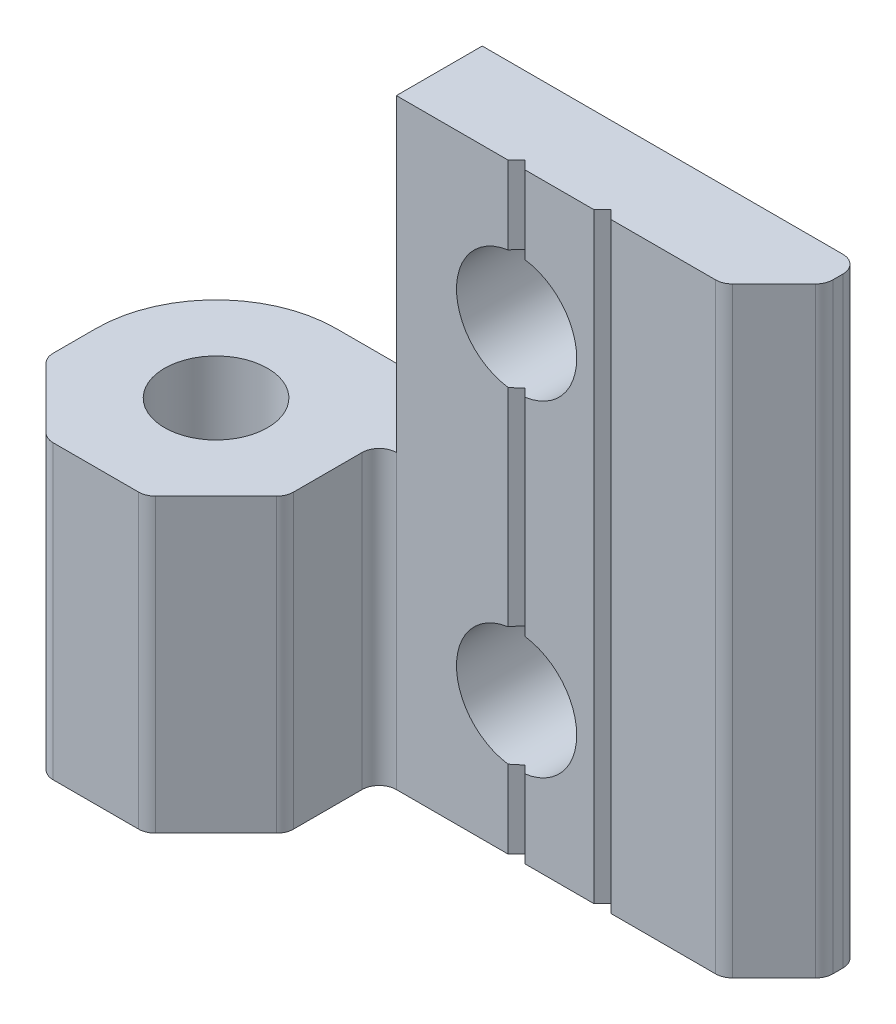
ISO-10303-21;
HEADER;
FILE_DESCRIPTION(('STEP AP214'),'2;1');
FILE_NAME('part.step','',(''),(''),'','','');
FILE_SCHEMA(('AUTOMOTIVE_DESIGN { 1 0 10303 214 1 1 1 1 }'));
ENDSEC;
DATA;
#1=APPLICATION_CONTEXT('core data for automotive mechanical design processes');
#2=APPLICATION_PROTOCOL_DEFINITION('international standard','automotive_design',2000,#1);
#3=PRODUCT_CONTEXT('',#1,'mechanical');
#4=PRODUCT('Part','Part','',(#3));
#5=PRODUCT_RELATED_PRODUCT_CATEGORY('part','',(#4));
#6=PRODUCT_DEFINITION_FORMATION('','',#4);
#7=PRODUCT_DEFINITION_CONTEXT('part definition',#1,'design');
#8=PRODUCT_DEFINITION('design','',#6,#7);
#9=PRODUCT_DEFINITION_SHAPE('','',#8);
#10=(LENGTH_UNIT() NAMED_UNIT(*) SI_UNIT(.MILLI.,.METRE.));
#11=(NAMED_UNIT(*) PLANE_ANGLE_UNIT() SI_UNIT($,.RADIAN.));
#12=(NAMED_UNIT(*) SI_UNIT($,.STERADIAN.) SOLID_ANGLE_UNIT());
#13=UNCERTAINTY_MEASURE_WITH_UNIT(LENGTH_MEASURE(1.E-05),#10,'distance_accuracy_value','');
#14=(GEOMETRIC_REPRESENTATION_CONTEXT(3) GLOBAL_UNCERTAINTY_ASSIGNED_CONTEXT((#13)) GLOBAL_UNIT_ASSIGNED_CONTEXT((#10,
#11,#12)) REPRESENTATION_CONTEXT('',''));
#15=CARTESIAN_POINT('',(0.,0.,0.));
#16=DIRECTION('',(0.,0.,1.));
#17=DIRECTION('',(1.,0.,0.));
#18=AXIS2_PLACEMENT_3D('',#15,#16,#17);
#19=CARTESIAN_POINT('',(15.,35.,-2.99999999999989));
#20=DIRECTION('',(-0.707106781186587,0.,-0.707106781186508));
#21=DIRECTION('',(-0.707106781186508,0.,0.707106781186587));
#22=AXIS2_PLACEMENT_3D('',#19,#20,#21);
#23=PLANE('',#22);
#24=DIRECTION('',(0.,-1.,0.));
#25=VECTOR('',#24,1.);
#26=CARTESIAN_POINT('',(14.5,35.,-2.49999999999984));
#27=LINE('',#26,#25);
#28=CARTESIAN_POINT('',(14.5,35.,-2.49999999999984));
#29=VERTEX_POINT('',#28);
#30=CARTESIAN_POINT('',(14.5,30.4641016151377,-2.49999999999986));
#31=VERTEX_POINT('',#30);
#32=EDGE_CURVE('E274',#29,#31,#27,.T.);
#33=ORIENTED_EDGE('',*,*,#32,.T.);
#34=CARTESIAN_POINT('',(15.,27.,-2.99999999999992));
#35=DIRECTION('',(-0.707106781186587,0.,-0.707106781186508));
#36=DIRECTION('',(-0.707106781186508,0.,0.707106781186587));
#37=AXIS2_PLACEMENT_3D('',#34,#35,#36);
#38=ELLIPSE('',#37,4.9497474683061,3.49999999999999);
#39=CARTESIAN_POINT('',(15.,30.5,-2.99999999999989));
#40=VERTEX_POINT('',#39);
#41=EDGE_CURVE('E257',#31,#40,#38,.T.);
#42=ORIENTED_EDGE('',*,*,#41,.T.);
#43=DIRECTION('',(0.,-1.,0.));
#44=VECTOR('',#43,1.);
#45=CARTESIAN_POINT('',(15.,35.,-2.99999999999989));
#46=LINE('',#45,#44);
#47=CARTESIAN_POINT('',(15.,35.,-2.99999999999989));
#48=VERTEX_POINT('',#47);
#49=EDGE_CURVE('E286',#48,#40,#46,.T.);
#50=ORIENTED_EDGE('',*,*,#49,.F.);
#51=DIRECTION('',(0.707106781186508,0.,-0.707106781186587));
#52=VECTOR('',#51,1.);
#53=CARTESIAN_POINT('',(15.,35.,-2.99999999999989));
#54=LINE('',#53,#52);
#55=EDGE_CURVE('E279',#29,#48,#54,.T.);
#56=ORIENTED_EDGE('',*,*,#55,.F.);
#57=EDGE_LOOP('',(#33,#42,#50,#56));
#58=FACE_BOUND('',#57,.T.);
#59=ADVANCED_FACE('F34',(#58),#23,.F.);
#60=CARTESIAN_POINT('',(15.,35.,-2.99999999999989));
#61=DIRECTION('',(0.707106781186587,0.,-0.707106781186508));
#62=DIRECTION('',(-0.707106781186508,0.,-0.707106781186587));
#63=AXIS2_PLACEMENT_3D('',#60,#61,#62);
#64=PLANE('',#63);
#65=DIRECTION('',(0.,-1.,0.));
#66=VECTOR('',#65,1.);
#67=CARTESIAN_POINT('',(15.5,35.,-2.49999999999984));
#68=LINE('',#67,#66);
#69=CARTESIAN_POINT('',(15.5,23.5358983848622,-2.49999999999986));
#70=VERTEX_POINT('',#69);
#71=CARTESIAN_POINT('',(15.5,11.4641016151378,-2.49999999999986));
#72=VERTEX_POINT('',#71);
#73=EDGE_CURVE('E302',#70,#72,#68,.T.);
#74=ORIENTED_EDGE('',*,*,#73,.F.);
#75=CARTESIAN_POINT('',(15.,27.,-2.99999999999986));
#76=DIRECTION('',(0.707106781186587,0.,-0.707106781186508));
#77=DIRECTION('',(0.707106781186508,0.,0.707106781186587));
#78=AXIS2_PLACEMENT_3D('',#75,#76,#77);
#79=ELLIPSE('',#78,4.9497474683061,3.49999999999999);
#80=CARTESIAN_POINT('',(15.,23.5,-2.99999999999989));
#81=VERTEX_POINT('',#80);
#82=EDGE_CURVE('E11',#70,#81,#79,.T.);
#83=ORIENTED_EDGE('',*,*,#82,.T.);
#84=CARTESIAN_POINT('',(15.,11.5,-2.99999999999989));
#85=VERTEX_POINT('',#84);
#86=EDGE_CURVE('E292',#81,#85,#46,.T.);
#87=ORIENTED_EDGE('',*,*,#86,.T.);
#88=CARTESIAN_POINT('',(15.,8.,-2.99999999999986));
#89=DIRECTION('',(0.707106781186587,0.,-0.707106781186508));
#90=DIRECTION('',(0.707106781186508,0.,0.707106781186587));
#91=AXIS2_PLACEMENT_3D('',#88,#89,#90);
#92=ELLIPSE('',#91,4.9497474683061,3.49999999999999);
#93=EDGE_CURVE('E490',#85,#72,#92,.T.);
#94=ORIENTED_EDGE('',*,*,#93,.T.);
#95=EDGE_LOOP('',(#74,#83,#87,#94));
#96=FACE_BOUND('',#95,.T.);
#97=ADVANCED_FACE('F506',(#96),#64,.F.);
#98=ORIENTED_EDGE('',*,*,#86,.F.);
#99=CARTESIAN_POINT('',(14.5,23.5358983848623,-2.49999999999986));
#100=VERTEX_POINT('',#99);
#101=EDGE_CURVE('E267',#81,#100,#38,.T.);
#102=ORIENTED_EDGE('',*,*,#101,.T.);
#103=CARTESIAN_POINT('',(14.5,11.4641016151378,-2.49999999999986));
#104=VERTEX_POINT('',#103);
#105=EDGE_CURVE('E277',#100,#104,#27,.T.);
#106=ORIENTED_EDGE('',*,*,#105,.T.);
#107=CARTESIAN_POINT('',(15.,8.,-2.99999999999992));
#108=DIRECTION('',(-0.707106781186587,0.,-0.707106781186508));
#109=DIRECTION('',(-0.707106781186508,0.,0.707106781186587));
#110=AXIS2_PLACEMENT_3D('',#107,#108,#109);
#111=ELLIPSE('',#110,4.9497474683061,3.49999999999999);
#112=EDGE_CURVE('E487',#104,#85,#111,.T.);
#113=ORIENTED_EDGE('',*,*,#112,.T.);
#114=EDGE_LOOP('',(#98,#102,#106,#113));
#115=FACE_BOUND('',#114,.T.);
#116=ADVANCED_FACE('F502',(#115),#23,.F.);
#117=CARTESIAN_POINT('',(15.5,4.53589838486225,-2.49999999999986));
#118=VERTEX_POINT('',#117);
#119=CARTESIAN_POINT('',(15.5,0.,-2.49999999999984));
#120=VERTEX_POINT('',#119);
#121=EDGE_CURVE('E303',#118,#120,#68,.T.);
#122=ORIENTED_EDGE('',*,*,#121,.F.);
#123=CARTESIAN_POINT('',(15.,4.50000000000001,-2.99999999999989));
#124=VERTEX_POINT('',#123);
#125=EDGE_CURVE('E57',#118,#124,#92,.T.);
#126=ORIENTED_EDGE('',*,*,#125,.T.);
#127=CARTESIAN_POINT('',(15.,0.,-2.99999999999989));
#128=VERTEX_POINT('',#127);
#129=EDGE_CURVE('E293',#124,#128,#46,.T.);
#130=ORIENTED_EDGE('',*,*,#129,.T.);
#131=DIRECTION('',(0.707106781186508,0.,0.707106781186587));
#132=VECTOR('',#131,1.);
#133=CARTESIAN_POINT('',(15.,0.,-2.99999999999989));
#134=LINE('',#133,#132);
#135=EDGE_CURVE('E345',#128,#120,#134,.T.);
#136=ORIENTED_EDGE('',*,*,#135,.T.);
#137=EDGE_LOOP('',(#122,#126,#130,#136));
#138=FACE_BOUND('',#137,.T.);
#139=ADVANCED_FACE('F556',(#138),#64,.F.);
#140=CARTESIAN_POINT('',(19.5,35.,-2.49999999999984));
#141=DIRECTION('',(0.,0.,-1.));
#142=DIRECTION('',(-1.,0.,0.));
#143=AXIS2_PLACEMENT_3D('',#140,#141,#142);
#144=PLANE('',#143);
#145=CARTESIAN_POINT('',(15.5,35.,-2.49999999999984));
#146=VERTEX_POINT('',#145);
#147=CARTESIAN_POINT('',(15.5,30.4641016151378,-2.49999999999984));
#148=VERTEX_POINT('',#147);
#149=EDGE_CURVE('E297',#146,#148,#68,.T.);
#150=ORIENTED_EDGE('',*,*,#149,.T.);
#151=CARTESIAN_POINT('',(15.,27.,-2.49999999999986));
#152=DIRECTION('',(0.,0.,1.));
#153=DIRECTION('',(1.,0.,0.));
#154=AXIS2_PLACEMENT_3D('',#151,#152,#153);
#155=CIRCLE('',#154,3.5);
#156=EDGE_CURVE('E49',#70,#148,#155,.T.);
#157=ORIENTED_EDGE('',*,*,#156,.F.);
#158=ORIENTED_EDGE('',*,*,#73,.T.);
#159=CARTESIAN_POINT('',(15.,8.,-2.49999999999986));
#160=DIRECTION('',(0.,0.,1.));
#161=DIRECTION('',(1.,0.,0.));
#162=AXIS2_PLACEMENT_3D('',#159,#160,#161);
#163=CIRCLE('',#162,3.5);
#164=EDGE_CURVE('E496',#118,#72,#163,.T.);
#165=ORIENTED_EDGE('',*,*,#164,.F.);
#166=ORIENTED_EDGE('',*,*,#121,.T.);
#167=DIRECTION('',(1.,0.,0.));
#168=VECTOR('',#167,1.);
#169=CARTESIAN_POINT('',(19.5,0.,-2.49999999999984));
#170=LINE('',#169,#168);
#171=CARTESIAN_POINT('',(19.5,0.,-2.49999999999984));
#172=VERTEX_POINT('',#171);
#173=EDGE_CURVE('E343',#120,#172,#170,.T.);
#174=ORIENTED_EDGE('',*,*,#173,.T.);
#175=DIRECTION('',(0.,-1.,0.));
#176=VECTOR('',#175,1.);
#177=CARTESIAN_POINT('',(19.5,35.,-2.49999999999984));
#178=LINE('',#177,#176);
#179=CARTESIAN_POINT('',(19.5,35.,-2.49999999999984));
#180=VERTEX_POINT('',#179);
#181=EDGE_CURVE('E308',#180,#172,#178,.T.);
#182=ORIENTED_EDGE('',*,*,#181,.F.);
#183=DIRECTION('',(1.,0.,0.));
#184=VECTOR('',#183,1.);
#185=CARTESIAN_POINT('',(19.5,35.,-2.49999999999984));
#186=LINE('',#185,#184);
#187=EDGE_CURVE('E413',#146,#180,#186,.T.);
#188=ORIENTED_EDGE('',*,*,#187,.F.);
#189=EDGE_LOOP('',(#150,#157,#158,#165,#166,#174,#182,#188));
#190=FACE_BOUND('',#189,.T.);
#191=ADVANCED_FACE('F508',(#190),#144,.F.);
#192=CARTESIAN_POINT('',(29.,35.,-5.91421356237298));
#193=DIRECTION('',(0.,1.,0.));
#194=DIRECTION('',(0.,0.,1.));
#195=AXIS2_PLACEMENT_3D('',#192,#193,#194);
#196=PLANE('',#195);
#197=DIRECTION('',(0.,0.,-1.));
#198=VECTOR('',#197,1.);
#199=CARTESIAN_POINT('',(8.00000000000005,35.,-5.91421356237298));
#200=LINE('',#199,#198);
#201=CARTESIAN_POINT('',(8.00000000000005,35.,-2.49999999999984));
#202=VERTEX_POINT('',#201);
#203=CARTESIAN_POINT('',(8.00000000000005,35.,-7.49999999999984));
#204=VERTEX_POINT('',#203);
#205=EDGE_CURVE('E431',#202,#204,#200,.T.);
#206=ORIENTED_EDGE('',*,*,#205,.F.);
#207=DIRECTION('',(1.,0.,0.));
#208=VECTOR('',#207,1.);
#209=CARTESIAN_POINT('',(14.5,35.,-2.49999999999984));
#210=LINE('',#209,#208);
#211=EDGE_CURVE('E418',#202,#29,#210,.T.);
#212=ORIENTED_EDGE('',*,*,#211,.T.);
#213=ORIENTED_EDGE('',*,*,#55,.T.);
#214=DIRECTION('',(0.707106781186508,0.,0.707106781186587));
#215=VECTOR('',#214,1.);
#216=CARTESIAN_POINT('',(15.,35.,-2.99999999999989));
#217=LINE('',#216,#215);
#218=EDGE_CURVE('E415',#48,#146,#217,.T.);
#219=ORIENTED_EDGE('',*,*,#218,.T.);
#220=ORIENTED_EDGE('',*,*,#187,.T.);
#221=DIRECTION('',(0.707106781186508,0.,-0.707106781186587));
#222=VECTOR('',#221,1.);
#223=CARTESIAN_POINT('',(20.,35.,-2.99999999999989));
#224=LINE('',#223,#222);
#225=CARTESIAN_POINT('',(20.,35.,-2.99999999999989));
#226=VERTEX_POINT('',#225);
#227=EDGE_CURVE('E411',#180,#226,#224,.T.);
#228=ORIENTED_EDGE('',*,*,#227,.T.);
#229=DIRECTION('',(0.707106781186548,0.,0.707106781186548));
#230=VECTOR('',#229,1.);
#231=CARTESIAN_POINT('',(20.,35.,-2.99999999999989));
#232=LINE('',#231,#230);
#233=CARTESIAN_POINT('',(20.4999999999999,35.,-2.49999999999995));
#234=VERTEX_POINT('',#233);
#235=EDGE_CURVE('E409',#226,#234,#232,.T.);
#236=ORIENTED_EDGE('',*,*,#235,.T.);
#237=DIRECTION('',(1.,0.,0.));
#238=VECTOR('',#237,1.);
#239=CARTESIAN_POINT('',(26.5857864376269,35.,-2.49999999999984));
#240=LINE('',#239,#238);
#241=CARTESIAN_POINT('',(26.5857864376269,35.,-2.49999999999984));
#242=VERTEX_POINT('',#241);
#243=EDGE_CURVE('E407',#234,#242,#240,.T.);
#244=ORIENTED_EDGE('',*,*,#243,.T.);
#245=CARTESIAN_POINT('',(26.5857864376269,35.,-3.49999999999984));
#246=DIRECTION('',(0.,1.,0.));
#247=DIRECTION('',(0.,0.,1.));
#248=AXIS2_PLACEMENT_3D('',#245,#246,#247);
#249=CIRCLE('',#248,1.00000000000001);
#250=CARTESIAN_POINT('',(27.2928932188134,35.,-2.79289321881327));
#251=VERTEX_POINT('',#250);
#252=EDGE_CURVE('E405',#242,#251,#249,.T.);
#253=ORIENTED_EDGE('',*,*,#252,.T.);
#254=DIRECTION('',(0.707106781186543,0.,-0.707106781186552));
#255=VECTOR('',#254,1.);
#256=CARTESIAN_POINT('',(29.7071067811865,35.,-5.20710678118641));
#257=LINE('',#256,#255);
#258=CARTESIAN_POINT('',(29.7071067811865,35.,-5.20710678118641));
#259=VERTEX_POINT('',#258);
#260=EDGE_CURVE('E331',#251,#259,#257,.T.);
#261=ORIENTED_EDGE('',*,*,#260,.T.);
#262=CARTESIAN_POINT('',(29.,35.,-5.91421356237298));
#263=DIRECTION('',(0.,1.,0.));
#264=DIRECTION('',(0.,0.,1.));
#265=AXIS2_PLACEMENT_3D('',#262,#263,#264);
#266=CIRCLE('',#265,1.00000000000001);
#267=CARTESIAN_POINT('',(30.,35.,-5.91421356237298));
#268=VERTEX_POINT('',#267);
#269=EDGE_CURVE('E334',#259,#268,#266,.T.);
#270=ORIENTED_EDGE('',*,*,#269,.T.);
#271=DIRECTION('',(0.,0.,-1.));
#272=VECTOR('',#271,1.);
#273=CARTESIAN_POINT('',(30.,35.,-5.91421356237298));
#274=LINE('',#273,#272);
#275=CARTESIAN_POINT('',(30.,35.,-6.49999999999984));
#276=VERTEX_POINT('',#275);
#277=EDGE_CURVE('E425',#268,#276,#274,.T.);
#278=ORIENTED_EDGE('',*,*,#277,.T.);
#279=CARTESIAN_POINT('',(29.,35.,-6.49999999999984));
#280=DIRECTION('',(0.,1.,0.));
#281=DIRECTION('',(0.,0.,1.));
#282=AXIS2_PLACEMENT_3D('',#279,#280,#281);
#283=CIRCLE('',#282,1.);
#284=CARTESIAN_POINT('',(29.,35.,-7.49999999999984));
#285=VERTEX_POINT('',#284);
#286=EDGE_CURVE('E423',#276,#285,#283,.T.);
#287=ORIENTED_EDGE('',*,*,#286,.T.);
#288=DIRECTION('',(-1.,0.,0.));
#289=VECTOR('',#288,1.);
#290=CARTESIAN_POINT('',(29.,35.,-7.49999999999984));
#291=LINE('',#290,#289);
#292=EDGE_CURVE('E420',#285,#204,#291,.T.);
#293=ORIENTED_EDGE('',*,*,#292,.T.);
#294=EDGE_LOOP('',(#206,#212,#213,#219,#220,#228,#236,#244,#253,#261,#270,#278,#287,#293));
#295=FACE_BOUND('',#294,.T.);
#296=ADVANCED_FACE('F536',(#295),#196,.T.);
#297=CARTESIAN_POINT('',(29.,0.,-5.91421356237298));
#298=DIRECTION('',(0.,1.,0.));
#299=DIRECTION('',(0.,0.,1.));
#300=AXIS2_PLACEMENT_3D('',#297,#298,#299);
#301=PLANE('',#300);
#302=CARTESIAN_POINT('',(29.,0.,-5.91421356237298));
#303=DIRECTION('',(0.,1.,0.));
#304=DIRECTION('',(0.,0.,1.));
#305=AXIS2_PLACEMENT_3D('',#302,#303,#304);
#306=CIRCLE('',#305,1.00000000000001);
#307=CARTESIAN_POINT('',(29.7071067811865,0.,-5.20710678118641));
#308=VERTEX_POINT('',#307);
#309=CARTESIAN_POINT('',(30.,0.,-5.91421356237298));
#310=VERTEX_POINT('',#309);
#311=EDGE_CURVE('E400',#308,#310,#306,.T.);
#312=ORIENTED_EDGE('',*,*,#311,.F.);
#313=DIRECTION('',(0.707106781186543,0.,-0.707106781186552));
#314=VECTOR('',#313,1.);
#315=CARTESIAN_POINT('',(29.7071067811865,0.,-5.20710678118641));
#316=LINE('',#315,#314);
#317=CARTESIAN_POINT('',(27.2928932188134,0.,-2.79289321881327));
#318=VERTEX_POINT('',#317);
#319=EDGE_CURVE('E332',#318,#308,#316,.T.);
#320=ORIENTED_EDGE('',*,*,#319,.F.);
#321=CARTESIAN_POINT('',(26.5857864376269,0.,-3.49999999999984));
#322=DIRECTION('',(0.,1.,0.));
#323=DIRECTION('',(0.,0.,1.));
#324=AXIS2_PLACEMENT_3D('',#321,#322,#323);
#325=CIRCLE('',#324,1.00000000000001);
#326=CARTESIAN_POINT('',(26.5857864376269,0.,-2.49999999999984));
#327=VERTEX_POINT('',#326);
#328=EDGE_CURVE('E335',#327,#318,#325,.T.);
#329=ORIENTED_EDGE('',*,*,#328,.F.);
#330=DIRECTION('',(1.,0.,0.));
#331=VECTOR('',#330,1.);
#332=CARTESIAN_POINT('',(26.5857864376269,0.,-2.49999999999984));
#333=LINE('',#332,#331);
#334=CARTESIAN_POINT('',(20.4999999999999,0.,-2.49999999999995));
#335=VERTEX_POINT('',#334);
#336=EDGE_CURVE('E337',#335,#327,#333,.T.);
#337=ORIENTED_EDGE('',*,*,#336,.F.);
#338=DIRECTION('',(0.707106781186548,0.,0.707106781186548));
#339=VECTOR('',#338,1.);
#340=CARTESIAN_POINT('',(20.,0.,-2.99999999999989));
#341=LINE('',#340,#339);
#342=CARTESIAN_POINT('',(20.,0.,-2.99999999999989));
#343=VERTEX_POINT('',#342);
#344=EDGE_CURVE('E339',#343,#335,#341,.T.);
#345=ORIENTED_EDGE('',*,*,#344,.F.);
#346=DIRECTION('',(0.707106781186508,0.,-0.707106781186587));
#347=VECTOR('',#346,1.);
#348=CARTESIAN_POINT('',(20.,0.,-2.99999999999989));
#349=LINE('',#348,#347);
#350=EDGE_CURVE('E341',#172,#343,#349,.T.);
#351=ORIENTED_EDGE('',*,*,#350,.F.);
#352=ORIENTED_EDGE('',*,*,#173,.F.);
#353=ORIENTED_EDGE('',*,*,#135,.F.);
#354=DIRECTION('',(0.707106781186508,0.,-0.707106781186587));
#355=VECTOR('',#354,1.);
#356=CARTESIAN_POINT('',(15.,0.,-2.99999999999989));
#357=LINE('',#356,#355);
#358=CARTESIAN_POINT('',(14.5,0.,-2.49999999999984));
#359=VERTEX_POINT('',#358);
#360=EDGE_CURVE('E347',#359,#128,#357,.T.);
#361=ORIENTED_EDGE('',*,*,#360,.F.);
#362=DIRECTION('',(1.,0.,0.));
#363=VECTOR('',#362,1.);
#364=CARTESIAN_POINT('',(14.5,0.,-2.49999999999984));
#365=LINE('',#364,#363);
#366=CARTESIAN_POINT('',(7.99999999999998,0.,-2.49999999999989));
#367=VERTEX_POINT('',#366);
#368=EDGE_CURVE('E349',#367,#359,#365,.T.);
#369=ORIENTED_EDGE('',*,*,#368,.F.);
#370=CARTESIAN_POINT('',(7.99999999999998,0.,-1.49999999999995));
#371=DIRECTION('',(0.,-1.,0.));
#372=DIRECTION('',(0.,0.,1.));
#373=AXIS2_PLACEMENT_3D('',#370,#371,#372);
#374=CIRCLE('',#373,0.999999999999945);
#375=CARTESIAN_POINT('',(6.99999999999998,0.,-1.49999999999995));
#376=VERTEX_POINT('',#375);
#377=EDGE_CURVE('E351',#376,#367,#374,.T.);
#378=ORIENTED_EDGE('',*,*,#377,.F.);
#379=DIRECTION('',(0.,0.,-1.));
#380=VECTOR('',#379,1.);
#381=CARTESIAN_POINT('',(6.99999999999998,0.,2.48528137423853));
#382=LINE('',#381,#380);
#383=CARTESIAN_POINT('',(6.99999999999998,0.,2.48528137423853));
#384=VERTEX_POINT('',#383);
#385=EDGE_CURVE('E354',#384,#376,#382,.T.);
#386=ORIENTED_EDGE('',*,*,#385,.F.);
#387=CARTESIAN_POINT('',(5.99999999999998,0.,2.48528137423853));
#388=DIRECTION('',(0.,1.,0.));
#389=DIRECTION('',(0.,0.,1.));
#390=AXIS2_PLACEMENT_3D('',#387,#388,#389);
#391=CIRCLE('',#390,0.999999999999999);
#392=CARTESIAN_POINT('',(6.70710678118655,0.,3.19238815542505));
#393=VERTEX_POINT('',#392);
#394=EDGE_CURVE('E357',#393,#384,#391,.T.);
#395=ORIENTED_EDGE('',*,*,#394,.F.);
#396=DIRECTION('',(0.707106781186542,0.,-0.707106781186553));
#397=VECTOR('',#396,1.);
#398=CARTESIAN_POINT('',(3.19238815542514,0.,6.70710678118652));
#399=LINE('',#398,#397);
#400=CARTESIAN_POINT('',(3.19238815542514,0.,6.70710678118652));
#401=VERTEX_POINT('',#400);
#402=EDGE_CURVE('E360',#401,#393,#399,.T.);
#403=ORIENTED_EDGE('',*,*,#402,.F.);
#404=CARTESIAN_POINT('',(2.48528137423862,0.,5.99999999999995));
#405=DIRECTION('',(0.,1.,0.));
#406=DIRECTION('',(0.,0.,1.));
#407=AXIS2_PLACEMENT_3D('',#404,#405,#406);
#408=CIRCLE('',#407,0.999999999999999);
#409=CARTESIAN_POINT('',(2.48528137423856,0.,6.99999999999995));
#410=VERTEX_POINT('',#409);
#411=EDGE_CURVE('E363',#410,#401,#408,.T.);
#412=ORIENTED_EDGE('',*,*,#411,.F.);
#413=DIRECTION('',(1.,0.,0.));
#414=VECTOR('',#413,1.);
#415=CARTESIAN_POINT('',(-2.48528137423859,0.,7.00000000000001));
#416=LINE('',#415,#414);
#417=CARTESIAN_POINT('',(-2.48528137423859,0.,7.00000000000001));
#418=VERTEX_POINT('',#417);
#419=EDGE_CURVE('E366',#418,#410,#416,.T.);
#420=ORIENTED_EDGE('',*,*,#419,.F.);
#421=CARTESIAN_POINT('',(-2.48528137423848,0.,6.00000000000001));
#422=DIRECTION('',(0.,1.,0.));
#423=DIRECTION('',(0.,0.,1.));
#424=AXIS2_PLACEMENT_3D('',#421,#422,#423);
#425=CIRCLE('',#424,1.00000000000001);
#426=CARTESIAN_POINT('',(-3.19238815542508,0.,6.70710678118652));
#427=VERTEX_POINT('',#426);
#428=EDGE_CURVE('E369',#427,#418,#425,.T.);
#429=ORIENTED_EDGE('',*,*,#428,.F.);
#430=DIRECTION('',(0.707106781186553,0.,0.707106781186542));
#431=VECTOR('',#430,1.);
#432=CARTESIAN_POINT('',(-6.70710678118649,0.,3.19238815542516));
#433=LINE('',#432,#431);
#434=CARTESIAN_POINT('',(-6.70710678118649,0.,3.19238815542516));
#435=VERTEX_POINT('',#434);
#436=EDGE_CURVE('E372',#435,#427,#433,.T.);
#437=ORIENTED_EDGE('',*,*,#436,.F.);
#438=CARTESIAN_POINT('',(-5.99999999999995,0.,2.48528137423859));
#439=DIRECTION('',(0.,1.,0.));
#440=DIRECTION('',(0.,0.,1.));
#441=AXIS2_PLACEMENT_3D('',#438,#439,#440);
#442=CIRCLE('',#441,1.00000000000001);
#443=CARTESIAN_POINT('',(-6.99999999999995,0.,2.48528137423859));
#444=VERTEX_POINT('',#443);
#445=EDGE_CURVE('E375',#444,#435,#442,.T.);
#446=ORIENTED_EDGE('',*,*,#445,.F.);
#447=DIRECTION('',(0.,0.,1.));
#448=VECTOR('',#447,1.);
#449=CARTESIAN_POINT('',(-7.00000000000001,0.,0.));
#450=LINE('',#449,#448);
#451=CARTESIAN_POINT('',(-6.99999999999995,0.,0.));
#452=VERTEX_POINT('',#451);
#453=EDGE_CURVE('E378',#452,#444,#450,.T.);
#454=ORIENTED_EDGE('',*,*,#453,.F.);
#455=CARTESIAN_POINT('',(0.,0.,0.));
#456=DIRECTION('',(0.,1.,0.));
#457=DIRECTION('',(0.,0.,1.));
#458=AXIS2_PLACEMENT_3D('',#455,#456,#457);
#459=CIRCLE('',#458,6.99999999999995);
#460=CARTESIAN_POINT('',(0.,0.,-6.9999999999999));
#461=VERTEX_POINT('',#460);
#462=EDGE_CURVE('E381',#461,#452,#459,.T.);
#463=ORIENTED_EDGE('',*,*,#462,.F.);
#464=DIRECTION('',(-1.,0.,0.));
#465=VECTOR('',#464,1.);
#466=CARTESIAN_POINT('',(0.,0.,-6.9999999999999));
#467=LINE('',#466,#465);
#468=CARTESIAN_POINT('',(4.63397459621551,0.,-6.99999999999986));
#469=VERTEX_POINT('',#468);
#470=EDGE_CURVE('E384',#469,#461,#467,.T.);
#471=ORIENTED_EDGE('',*,*,#470,.F.);
#472=CARTESIAN_POINT('',(4.63397459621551,0.,-7.49999999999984));
#473=DIRECTION('',(0.,-1.,0.));
#474=DIRECTION('',(0.,0.,1.));
#475=AXIS2_PLACEMENT_3D('',#472,#473,#474);
#476=CIRCLE('',#475,0.499999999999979);
#477=CARTESIAN_POINT('',(5.06698729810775,0.,-7.24999999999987));
#478=VERTEX_POINT('',#477);
#479=EDGE_CURVE('E387',#478,#469,#476,.T.);
#480=ORIENTED_EDGE('',*,*,#479,.F.);
#481=CARTESIAN_POINT('',(5.49999999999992,0.,-6.9999999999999));
#482=DIRECTION('',(0.,1.,0.));
#483=DIRECTION('',(0.,0.,1.));
#484=AXIS2_PLACEMENT_3D('',#481,#482,#483);
#485=CIRCLE('',#484,0.499999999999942);
#486=CARTESIAN_POINT('',(5.49999999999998,0.,-7.49999999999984));
#487=VERTEX_POINT('',#486);
#488=EDGE_CURVE('E390',#487,#478,#485,.T.);
#489=ORIENTED_EDGE('',*,*,#488,.F.);
#490=DIRECTION('',(-1.,0.,0.));
#491=VECTOR('',#490,1.);
#492=CARTESIAN_POINT('',(29.,0.,-7.49999999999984));
#493=LINE('',#492,#491);
#494=CARTESIAN_POINT('',(29.,0.,-7.49999999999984));
#495=VERTEX_POINT('',#494);
#496=EDGE_CURVE('E393',#495,#487,#493,.T.);
#497=ORIENTED_EDGE('',*,*,#496,.F.);
#498=CARTESIAN_POINT('',(29.,0.,-6.49999999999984));
#499=DIRECTION('',(0.,1.,0.));
#500=DIRECTION('',(0.,0.,1.));
#501=AXIS2_PLACEMENT_3D('',#498,#499,#500);
#502=CIRCLE('',#501,1.);
#503=CARTESIAN_POINT('',(30.,0.,-6.49999999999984));
#504=VERTEX_POINT('',#503);
#505=EDGE_CURVE('E396',#504,#495,#502,.T.);
#506=ORIENTED_EDGE('',*,*,#505,.F.);
#507=DIRECTION('',(0.,0.,-1.));
#508=VECTOR('',#507,1.);
#509=CARTESIAN_POINT('',(30.,0.,-5.91421356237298));
#510=LINE('',#509,#508);
#511=EDGE_CURVE('E398',#310,#504,#510,.T.);
#512=ORIENTED_EDGE('',*,*,#511,.F.);
#513=EDGE_LOOP('',(#312,#320,#329,#337,#345,#351,#352,#353,#361,#369,#378,#386,#395,#403,#412,
#420,#429,#437,#446,#454,#463,#471,#480,#489,#497,#506,#512));
#514=FACE_BOUND('',#513,.T.);
#515=CARTESIAN_POINT('',(0.,0.,0.));
#516=DIRECTION('',(0.,1.,0.));
#517=DIRECTION('',(0.,0.,1.));
#518=AXIS2_PLACEMENT_3D('',#515,#516,#517);
#519=CIRCLE('',#518,3.);
#520=CARTESIAN_POINT('',(0.,0.,3.));
#521=VERTEX_POINT('',#520);
#522=EDGE_CURVE('E403',#521,#521,#519,.T.);
#523=ORIENTED_EDGE('',*,*,#522,.T.);
#524=EDGE_LOOP('',(#523));
#525=FACE_BOUND('',#524,.T.);
#526=ADVANCED_FACE('F534',(#514,#525),#301,.F.);
#527=CARTESIAN_POINT('',(29.,35.,-5.91421356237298));
#528=DIRECTION('',(0.,-1.,0.));
#529=DIRECTION('',(0.,0.,-1.));
#530=AXIS2_PLACEMENT_3D('',#527,#528,#529);
#531=CYLINDRICAL_SURFACE('',#530,1.00000000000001);
#532=ORIENTED_EDGE('',*,*,#311,.T.);
#533=DIRECTION('',(0.,-1.,0.));
#534=VECTOR('',#533,1.);
#535=CARTESIAN_POINT('',(30.,35.,-5.91421356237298));
#536=LINE('',#535,#534);
#537=EDGE_CURVE('E511',#268,#310,#536,.T.);
#538=ORIENTED_EDGE('',*,*,#537,.F.);
#539=ORIENTED_EDGE('',*,*,#269,.F.);
#540=DIRECTION('',(0.,-1.,0.));
#541=VECTOR('',#540,1.);
#542=CARTESIAN_POINT('',(29.7071067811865,35.,-5.20710678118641));
#543=LINE('',#542,#541);
#544=EDGE_CURVE('E328',#259,#308,#543,.T.);
#545=ORIENTED_EDGE('',*,*,#544,.T.);
#546=EDGE_LOOP('',(#532,#538,#539,#545));
#547=FACE_BOUND('',#546,.T.);
#548=ADVANCED_FACE('F36',(#547),#531,.T.);
#549=CARTESIAN_POINT('',(30.,35.,-5.91421356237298));
#550=DIRECTION('',(-1.,0.,0.));
#551=DIRECTION('',(0.,0.,1.));
#552=AXIS2_PLACEMENT_3D('',#549,#550,#551);
#553=PLANE('',#552);
#554=ORIENTED_EDGE('',*,*,#511,.T.);
#555=DIRECTION('',(0.,-1.,0.));
#556=VECTOR('',#555,1.);
#557=CARTESIAN_POINT('',(30.,35.,-6.49999999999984));
#558=LINE('',#557,#556);
#559=EDGE_CURVE('E513',#276,#504,#558,.T.);
#560=ORIENTED_EDGE('',*,*,#559,.F.);
#561=ORIENTED_EDGE('',*,*,#277,.F.);
#562=ORIENTED_EDGE('',*,*,#537,.T.);
#563=EDGE_LOOP('',(#554,#560,#561,#562));
#564=FACE_BOUND('',#563,.T.);
#565=ADVANCED_FACE('F543',(#564),#553,.F.);
#566=CARTESIAN_POINT('',(29.,35.,-6.49999999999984));
#567=DIRECTION('',(0.,-1.,0.));
#568=DIRECTION('',(0.,0.,-1.));
#569=AXIS2_PLACEMENT_3D('',#566,#567,#568);
#570=CYLINDRICAL_SURFACE('',#569,1.);
#571=ORIENTED_EDGE('',*,*,#505,.T.);
#572=DIRECTION('',(0.,-1.,0.));
#573=VECTOR('',#572,1.);
#574=CARTESIAN_POINT('',(29.,35.,-7.49999999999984));
#575=LINE('',#574,#573);
#576=EDGE_CURVE('E518',#285,#495,#575,.T.);
#577=ORIENTED_EDGE('',*,*,#576,.F.);
#578=ORIENTED_EDGE('',*,*,#286,.F.);
#579=ORIENTED_EDGE('',*,*,#559,.T.);
#580=EDGE_LOOP('',(#571,#577,#578,#579));
#581=FACE_BOUND('',#580,.T.);
#582=ADVANCED_FACE('F605',(#581),#570,.T.);
#583=CARTESIAN_POINT('',(29.,35.,-7.49999999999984));
#584=DIRECTION('',(0.,0.,1.));
#585=DIRECTION('',(1.,0.,0.));
#586=AXIS2_PLACEMENT_3D('',#583,#584,#585);
#587=PLANE('',#586);
#588=CARTESIAN_POINT('',(15.,27.,-7.49999999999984));
#589=DIRECTION('',(0.,0.,1.));
#590=DIRECTION('',(1.,0.,0.));
#591=AXIS2_PLACEMENT_3D('',#588,#589,#590);
#592=CIRCLE('',#591,3.49999999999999);
#593=CARTESIAN_POINT('',(18.5,27.,-7.49999999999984));
#594=VERTEX_POINT('',#593);
#595=EDGE_CURVE('E495',#594,#594,#592,.T.);
#596=ORIENTED_EDGE('',*,*,#595,.T.);
#597=EDGE_LOOP('',(#596));
#598=FACE_BOUND('',#597,.T.);
#599=CARTESIAN_POINT('',(15.,8.,-7.49999999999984));
#600=DIRECTION('',(0.,0.,1.));
#601=DIRECTION('',(1.,0.,0.));
#602=AXIS2_PLACEMENT_3D('',#599,#600,#601);
#603=CIRCLE('',#602,3.49999999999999);
#604=CARTESIAN_POINT('',(18.5,8.,-7.49999999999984));
#605=VERTEX_POINT('',#604);
#606=EDGE_CURVE('E483',#605,#605,#603,.T.);
#607=ORIENTED_EDGE('',*,*,#606,.T.);
#608=EDGE_LOOP('',(#607));
#609=FACE_BOUND('',#608,.T.);
#610=DIRECTION('',(-1.,0.,0.));
#611=VECTOR('',#610,1.);
#612=CARTESIAN_POINT('',(8.00000000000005,17.,-7.49999999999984));
#613=LINE('',#612,#611);
#614=CARTESIAN_POINT('',(8.00000000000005,17.,-7.49999999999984));
#615=VERTEX_POINT('',#614);
#616=CARTESIAN_POINT('',(5.49999999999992,17.,-7.49999999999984));
#617=VERTEX_POINT('',#616);
#618=EDGE_CURVE('E479',#615,#617,#613,.T.);
#619=ORIENTED_EDGE('',*,*,#618,.F.);
#620=DIRECTION('',(0.,-1.,0.));
#621=VECTOR('',#620,1.);
#622=CARTESIAN_POINT('',(8.00000000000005,17.,-7.49999999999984));
#623=LINE('',#622,#621);
#624=EDGE_CURVE('E481',#204,#615,#623,.T.);
#625=ORIENTED_EDGE('',*,*,#624,.F.);
#626=ORIENTED_EDGE('',*,*,#292,.F.);
#627=ORIENTED_EDGE('',*,*,#576,.T.);
#628=ORIENTED_EDGE('',*,*,#496,.T.);
#629=DIRECTION('',(0.,-1.,0.));
#630=VECTOR('',#629,1.);
#631=CARTESIAN_POINT('',(5.49999999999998,35.,-7.49999999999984));
#632=LINE('',#631,#630);
#633=EDGE_CURVE('E648',#617,#487,#632,.T.);
#634=ORIENTED_EDGE('',*,*,#633,.F.);
#635=EDGE_LOOP('',(#619,#625,#626,#627,#628,#634));
#636=FACE_BOUND('',#635,.T.);
#637=ADVANCED_FACE('F651',(#598,#609,#636),#587,.F.);
#638=CARTESIAN_POINT('',(5.49999999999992,35.,-6.9999999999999));
#639=DIRECTION('',(0.,-1.,0.));
#640=DIRECTION('',(0.,0.,-1.));
#641=AXIS2_PLACEMENT_3D('',#638,#639,#640);
#642=CYLINDRICAL_SURFACE('',#641,0.499999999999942);
#643=DIRECTION('',(0.,-1.,0.));
#644=VECTOR('',#643,1.);
#645=CARTESIAN_POINT('',(5.06698729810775,35.,-7.24999999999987));
#646=LINE('',#645,#644);
#647=CARTESIAN_POINT('',(5.06698729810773,17.,-7.24999999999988));
#648=VERTEX_POINT('',#647);
#649=EDGE_CURVE('E646',#648,#478,#646,.T.);
#650=ORIENTED_EDGE('',*,*,#649,.F.);
#651=CARTESIAN_POINT('',(5.49999999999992,17.,-6.9999999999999));
#652=DIRECTION('',(0.,-1.,0.));
#653=DIRECTION('',(0.,0.,-1.));
#654=AXIS2_PLACEMENT_3D('',#651,#652,#653);
#655=CIRCLE('',#654,0.499999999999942);
#656=EDGE_CURVE('E433',#648,#617,#655,.T.);
#657=ORIENTED_EDGE('',*,*,#656,.T.);
#658=ORIENTED_EDGE('',*,*,#633,.T.);
#659=ORIENTED_EDGE('',*,*,#488,.T.);
#660=EDGE_LOOP('',(#650,#657,#658,#659));
#661=FACE_BOUND('',#660,.T.);
#662=ADVANCED_FACE('F659',(#661),#642,.T.);
#663=CARTESIAN_POINT('',(4.63397459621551,35.,-7.49999999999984));
#664=DIRECTION('',(0.,-1.,0.));
#665=DIRECTION('',(0.,0.,-1.));
#666=AXIS2_PLACEMENT_3D('',#663,#664,#665);
#667=CYLINDRICAL_SURFACE('',#666,0.499999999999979);
#668=DIRECTION('',(0.,-1.,0.));
#669=VECTOR('',#668,1.);
#670=CARTESIAN_POINT('',(4.63397459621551,35.,-6.99999999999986));
#671=LINE('',#670,#669);
#672=CARTESIAN_POINT('',(4.63397459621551,17.,-6.9999999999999));
#673=VERTEX_POINT('',#672);
#674=EDGE_CURVE('E644',#673,#469,#671,.T.);
#675=ORIENTED_EDGE('',*,*,#674,.F.);
#676=CARTESIAN_POINT('',(4.63397459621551,17.,-7.49999999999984));
#677=DIRECTION('',(0.,-1.,0.));
#678=DIRECTION('',(0.,0.,-1.));
#679=AXIS2_PLACEMENT_3D('',#676,#677,#678);
#680=CIRCLE('',#679,0.499999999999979);
#681=EDGE_CURVE('E436',#673,#648,#680,.F.);
#682=ORIENTED_EDGE('',*,*,#681,.T.);
#683=ORIENTED_EDGE('',*,*,#649,.T.);
#684=ORIENTED_EDGE('',*,*,#479,.T.);
#685=EDGE_LOOP('',(#675,#682,#683,#684));
#686=FACE_BOUND('',#685,.T.);
#687=ADVANCED_FACE('F869',(#686),#667,.F.);
#688=CARTESIAN_POINT('',(0.,35.,-6.9999999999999));
#689=DIRECTION('',(0.,0.,1.));
#690=DIRECTION('',(1.,0.,0.));
#691=AXIS2_PLACEMENT_3D('',#688,#689,#690);
#692=PLANE('',#691);
#693=DIRECTION('',(0.,-1.,0.));
#694=VECTOR('',#693,1.);
#695=CARTESIAN_POINT('',(0.,35.,-6.9999999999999));
#696=LINE('',#695,#694);
#697=CARTESIAN_POINT('',(0.,17.,-6.99999999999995));
#698=VERTEX_POINT('',#697);
#699=EDGE_CURVE('E642',#698,#461,#696,.T.);
#700=ORIENTED_EDGE('',*,*,#699,.F.);
#701=DIRECTION('',(1.,0.,0.));
#702=VECTOR('',#701,1.);
#703=CARTESIAN_POINT('',(0.,17.,-6.9999999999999));
#704=LINE('',#703,#702);
#705=EDGE_CURVE('E439',#698,#673,#704,.T.);
#706=ORIENTED_EDGE('',*,*,#705,.T.);
#707=ORIENTED_EDGE('',*,*,#674,.T.);
#708=ORIENTED_EDGE('',*,*,#470,.T.);
#709=EDGE_LOOP('',(#700,#706,#707,#708));
#710=FACE_BOUND('',#709,.T.);
#711=ADVANCED_FACE('F859',(#710),#692,.F.);
#712=CARTESIAN_POINT('',(0.,35.,0.));
#713=DIRECTION('',(0.,-1.,0.));
#714=DIRECTION('',(0.,0.,-1.));
#715=AXIS2_PLACEMENT_3D('',#712,#713,#714);
#716=CYLINDRICAL_SURFACE('',#715,6.99999999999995);
#717=DIRECTION('',(0.,-1.,0.));
#718=VECTOR('',#717,1.);
#719=CARTESIAN_POINT('',(-6.99999999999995,35.,0.));
#720=LINE('',#719,#718);
#721=CARTESIAN_POINT('',(-7.00000000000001,17.,0.));
#722=VERTEX_POINT('',#721);
#723=EDGE_CURVE('E640',#722,#452,#720,.T.);
#724=ORIENTED_EDGE('',*,*,#723,.F.);
#725=CARTESIAN_POINT('',(0.,17.,0.));
#726=DIRECTION('',(0.,-1.,0.));
#727=DIRECTION('',(0.,0.,-1.));
#728=AXIS2_PLACEMENT_3D('',#725,#726,#727);
#729=CIRCLE('',#728,6.99999999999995);
#730=EDGE_CURVE('E442',#722,#698,#729,.T.);
#731=ORIENTED_EDGE('',*,*,#730,.T.);
#732=ORIENTED_EDGE('',*,*,#699,.T.);
#733=ORIENTED_EDGE('',*,*,#462,.T.);
#734=EDGE_LOOP('',(#724,#731,#732,#733));
#735=FACE_BOUND('',#734,.T.);
#736=ADVANCED_FACE('F849',(#735),#716,.T.);
#737=CARTESIAN_POINT('',(-7.00000000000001,35.,0.));
#738=DIRECTION('',(1.,0.,0.));
#739=DIRECTION('',(0.,0.,-1.));
#740=AXIS2_PLACEMENT_3D('',#737,#738,#739);
#741=PLANE('',#740);
#742=DIRECTION('',(0.,-1.,0.));
#743=VECTOR('',#742,1.);
#744=CARTESIAN_POINT('',(-6.99999999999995,35.,2.48528137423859));
#745=LINE('',#744,#743);
#746=CARTESIAN_POINT('',(-6.99999999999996,17.,2.48528137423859));
#747=VERTEX_POINT('',#746);
#748=EDGE_CURVE('E638',#747,#444,#745,.T.);
#749=ORIENTED_EDGE('',*,*,#748,.F.);
#750=DIRECTION('',(0.,0.,-1.));
#751=VECTOR('',#750,1.);
#752=CARTESIAN_POINT('',(-7.00000000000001,17.,0.));
#753=LINE('',#752,#751);
#754=EDGE_CURVE('E445',#747,#722,#753,.T.);
#755=ORIENTED_EDGE('',*,*,#754,.T.);
#756=ORIENTED_EDGE('',*,*,#723,.T.);
#757=ORIENTED_EDGE('',*,*,#453,.T.);
#758=EDGE_LOOP('',(#749,#755,#756,#757));
#759=FACE_BOUND('',#758,.T.);
#760=ADVANCED_FACE('F839',(#759),#741,.F.);
#761=CARTESIAN_POINT('',(-5.99999999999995,35.,2.48528137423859));
#762=DIRECTION('',(0.,-1.,0.));
#763=DIRECTION('',(0.,0.,-1.));
#764=AXIS2_PLACEMENT_3D('',#761,#762,#763);
#765=CYLINDRICAL_SURFACE('',#764,1.00000000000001);
#766=DIRECTION('',(0.,-1.,0.));
#767=VECTOR('',#766,1.);
#768=CARTESIAN_POINT('',(-6.70710678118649,35.,3.19238815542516));
#769=LINE('',#768,#767);
#770=CARTESIAN_POINT('',(-6.70710678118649,17.,3.19238815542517));
#771=VERTEX_POINT('',#770);
#772=EDGE_CURVE('E636',#771,#435,#769,.T.);
#773=ORIENTED_EDGE('',*,*,#772,.F.);
#774=CARTESIAN_POINT('',(-5.99999999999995,17.,2.48528137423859));
#775=DIRECTION('',(0.,-1.,0.));
#776=DIRECTION('',(0.,0.,-1.));
#777=AXIS2_PLACEMENT_3D('',#774,#775,#776);
#778=CIRCLE('',#777,1.00000000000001);
#779=EDGE_CURVE('E448',#771,#747,#778,.T.);
#780=ORIENTED_EDGE('',*,*,#779,.T.);
#781=ORIENTED_EDGE('',*,*,#748,.T.);
#782=ORIENTED_EDGE('',*,*,#445,.T.);
#783=EDGE_LOOP('',(#773,#780,#781,#782));
#784=FACE_BOUND('',#783,.T.);
#785=ADVANCED_FACE('F829',(#784),#765,.T.);
#786=CARTESIAN_POINT('',(-6.70710678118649,35.,3.19238815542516));
#787=DIRECTION('',(0.707106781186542,0.,-0.707106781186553));
#788=DIRECTION('',(-0.707106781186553,0.,-0.707106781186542));
#789=AXIS2_PLACEMENT_3D('',#786,#787,#788);
#790=PLANE('',#789);
#791=DIRECTION('',(0.,-1.,0.));
#792=VECTOR('',#791,1.);
#793=CARTESIAN_POINT('',(-3.19238815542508,35.,6.70710678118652));
#794=LINE('',#793,#792);
#795=CARTESIAN_POINT('',(-3.19238815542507,17.,6.70710678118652));
#796=VERTEX_POINT('',#795);
#797=EDGE_CURVE('E634',#796,#427,#794,.T.);
#798=ORIENTED_EDGE('',*,*,#797,.F.);
#799=DIRECTION('',(-0.707106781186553,0.,-0.707106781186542));
#800=VECTOR('',#799,1.);
#801=CARTESIAN_POINT('',(-6.70710678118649,17.,3.19238815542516));
#802=LINE('',#801,#800);
#803=EDGE_CURVE('E451',#796,#771,#802,.T.);
#804=ORIENTED_EDGE('',*,*,#803,.T.);
#805=ORIENTED_EDGE('',*,*,#772,.T.);
#806=ORIENTED_EDGE('',*,*,#436,.T.);
#807=EDGE_LOOP('',(#798,#804,#805,#806));
#808=FACE_BOUND('',#807,.T.);
#809=ADVANCED_FACE('F819',(#808),#790,.F.);
#810=CARTESIAN_POINT('',(-2.48528137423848,35.,6.00000000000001));
#811=DIRECTION('',(0.,-1.,0.));
#812=DIRECTION('',(0.,0.,-1.));
#813=AXIS2_PLACEMENT_3D('',#810,#811,#812);
#814=CYLINDRICAL_SURFACE('',#813,1.00000000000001);
#815=DIRECTION('',(0.,-1.,0.));
#816=VECTOR('',#815,1.);
#817=CARTESIAN_POINT('',(-2.48528137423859,35.,7.00000000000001));
#818=LINE('',#817,#816);
#819=CARTESIAN_POINT('',(-2.48528137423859,17.,7.00000000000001));
#820=VERTEX_POINT('',#819);
#821=EDGE_CURVE('E632',#820,#418,#818,.T.);
#822=ORIENTED_EDGE('',*,*,#821,.F.);
#823=CARTESIAN_POINT('',(-2.48528137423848,17.,6.00000000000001));
#824=DIRECTION('',(0.,-1.,0.));
#825=DIRECTION('',(0.,0.,-1.));
#826=AXIS2_PLACEMENT_3D('',#823,#824,#825);
#827=CIRCLE('',#826,1.00000000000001);
#828=EDGE_CURVE('E454',#820,#796,#827,.T.);
#829=ORIENTED_EDGE('',*,*,#828,.T.);
#830=ORIENTED_EDGE('',*,*,#797,.T.);
#831=ORIENTED_EDGE('',*,*,#428,.T.);
#832=EDGE_LOOP('',(#822,#829,#830,#831));
#833=FACE_BOUND('',#832,.T.);
#834=ADVANCED_FACE('F809',(#833),#814,.T.);
#835=CARTESIAN_POINT('',(-2.48528137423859,35.,7.00000000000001));
#836=DIRECTION('',(0.,0.,-1.));
#837=DIRECTION('',(-1.,0.,0.));
#838=AXIS2_PLACEMENT_3D('',#835,#836,#837);
#839=PLANE('',#838);
#840=DIRECTION('',(0.,-1.,0.));
#841=VECTOR('',#840,1.);
#842=CARTESIAN_POINT('',(2.48528137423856,35.,6.99999999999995));
#843=LINE('',#842,#841);
#844=CARTESIAN_POINT('',(2.48528137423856,17.,6.99999999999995));
#845=VERTEX_POINT('',#844);
#846=EDGE_CURVE('E630',#845,#410,#843,.T.);
#847=ORIENTED_EDGE('',*,*,#846,.F.);
#848=DIRECTION('',(-1.,0.,0.));
#849=VECTOR('',#848,1.);
#850=CARTESIAN_POINT('',(-2.48528137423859,17.,7.00000000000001));
#851=LINE('',#850,#849);
#852=EDGE_CURVE('E457',#845,#820,#851,.T.);
#853=ORIENTED_EDGE('',*,*,#852,.T.);
#854=ORIENTED_EDGE('',*,*,#821,.T.);
#855=ORIENTED_EDGE('',*,*,#419,.T.);
#856=EDGE_LOOP('',(#847,#853,#854,#855));
#857=FACE_BOUND('',#856,.T.);
#858=ADVANCED_FACE('F799',(#857),#839,.F.);
#859=CARTESIAN_POINT('',(2.48528137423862,35.,5.99999999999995));
#860=DIRECTION('',(0.,-1.,0.));
#861=DIRECTION('',(0.,0.,-1.));
#862=AXIS2_PLACEMENT_3D('',#859,#860,#861);
#863=CYLINDRICAL_SURFACE('',#862,0.999999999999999);
#864=DIRECTION('',(0.,-1.,0.));
#865=VECTOR('',#864,1.);
#866=CARTESIAN_POINT('',(3.19238815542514,35.,6.70710678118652));
#867=LINE('',#866,#865);
#868=CARTESIAN_POINT('',(3.19238815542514,17.,6.70710678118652));
#869=VERTEX_POINT('',#868);
#870=EDGE_CURVE('E628',#869,#401,#867,.T.);
#871=ORIENTED_EDGE('',*,*,#870,.F.);
#872=CARTESIAN_POINT('',(2.48528137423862,17.,5.99999999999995));
#873=DIRECTION('',(0.,-1.,0.));
#874=DIRECTION('',(0.,0.,-1.));
#875=AXIS2_PLACEMENT_3D('',#872,#873,#874);
#876=CIRCLE('',#875,0.999999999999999);
#877=EDGE_CURVE('E460',#869,#845,#876,.T.);
#878=ORIENTED_EDGE('',*,*,#877,.T.);
#879=ORIENTED_EDGE('',*,*,#846,.T.);
#880=ORIENTED_EDGE('',*,*,#411,.T.);
#881=EDGE_LOOP('',(#871,#878,#879,#880));
#882=FACE_BOUND('',#881,.T.);
#883=ADVANCED_FACE('F789',(#882),#863,.T.);
#884=CARTESIAN_POINT('',(3.19238815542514,35.,6.70710678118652));
#885=DIRECTION('',(-0.707106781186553,0.,-0.707106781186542));
#886=DIRECTION('',(-0.707106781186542,0.,0.707106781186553));
#887=AXIS2_PLACEMENT_3D('',#884,#885,#886);
#888=PLANE('',#887);
#889=DIRECTION('',(0.,-1.,0.));
#890=VECTOR('',#889,1.);
#891=CARTESIAN_POINT('',(6.70710678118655,35.,3.19238815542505));
#892=LINE('',#891,#890);
#893=CARTESIAN_POINT('',(6.70710678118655,17.,3.19238815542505));
#894=VERTEX_POINT('',#893);
#895=EDGE_CURVE('E626',#894,#393,#892,.T.);
#896=ORIENTED_EDGE('',*,*,#895,.F.);
#897=DIRECTION('',(-0.707106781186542,0.,0.707106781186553));
#898=VECTOR('',#897,1.);
#899=CARTESIAN_POINT('',(3.19238815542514,17.,6.70710678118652));
#900=LINE('',#899,#898);
#901=EDGE_CURVE('E463',#894,#869,#900,.T.);
#902=ORIENTED_EDGE('',*,*,#901,.T.);
#903=ORIENTED_EDGE('',*,*,#870,.T.);
#904=ORIENTED_EDGE('',*,*,#402,.T.);
#905=EDGE_LOOP('',(#896,#902,#903,#904));
#906=FACE_BOUND('',#905,.T.);
#907=ADVANCED_FACE('F779',(#906),#888,.F.);
#908=CARTESIAN_POINT('',(5.99999999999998,35.,2.48528137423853));
#909=DIRECTION('',(0.,-1.,0.));
#910=DIRECTION('',(0.,0.,-1.));
#911=AXIS2_PLACEMENT_3D('',#908,#909,#910);
#912=CYLINDRICAL_SURFACE('',#911,0.999999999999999);
#913=DIRECTION('',(0.,-1.,0.));
#914=VECTOR('',#913,1.);
#915=CARTESIAN_POINT('',(6.99999999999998,35.,2.48528137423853));
#916=LINE('',#915,#914);
#917=CARTESIAN_POINT('',(6.99999999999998,17.,2.48528137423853));
#918=VERTEX_POINT('',#917);
#919=EDGE_CURVE('E622',#918,#384,#916,.T.);
#920=ORIENTED_EDGE('',*,*,#919,.F.);
#921=CARTESIAN_POINT('',(5.99999999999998,17.,2.48528137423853));
#922=DIRECTION('',(0.,-1.,0.));
#923=DIRECTION('',(0.,0.,-1.));
#924=AXIS2_PLACEMENT_3D('',#921,#922,#923);
#925=CIRCLE('',#924,0.999999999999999);
#926=EDGE_CURVE('E466',#918,#894,#925,.T.);
#927=ORIENTED_EDGE('',*,*,#926,.T.);
#928=ORIENTED_EDGE('',*,*,#895,.T.);
#929=ORIENTED_EDGE('',*,*,#394,.T.);
#930=EDGE_LOOP('',(#920,#927,#928,#929));
#931=FACE_BOUND('',#930,.T.);
#932=ADVANCED_FACE('F769',(#931),#912,.T.);
#933=CARTESIAN_POINT('',(6.99999999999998,35.,2.48528137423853));
#934=DIRECTION('',(-1.,0.,0.));
#935=DIRECTION('',(0.,0.,1.));
#936=AXIS2_PLACEMENT_3D('',#933,#934,#935);
#937=PLANE('',#936);
#938=DIRECTION('',(0.,-1.,0.));
#939=VECTOR('',#938,1.);
#940=CARTESIAN_POINT('',(6.99999999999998,35.,-1.49999999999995));
#941=LINE('',#940,#939);
#942=CARTESIAN_POINT('',(7.00000000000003,17.,-1.49999999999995));
#943=VERTEX_POINT('',#942);
#944=EDGE_CURVE('E621',#943,#376,#941,.T.);
#945=ORIENTED_EDGE('',*,*,#944,.F.);
#946=DIRECTION('',(0.,0.,1.));
#947=VECTOR('',#946,1.);
#948=CARTESIAN_POINT('',(6.99999999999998,17.,2.48528137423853));
#949=LINE('',#948,#947);
#950=EDGE_CURVE('E469',#943,#918,#949,.T.);
#951=ORIENTED_EDGE('',*,*,#950,.T.);
#952=ORIENTED_EDGE('',*,*,#919,.T.);
#953=ORIENTED_EDGE('',*,*,#385,.T.);
#954=EDGE_LOOP('',(#945,#951,#952,#953));
#955=FACE_BOUND('',#954,.T.);
#956=ADVANCED_FACE('F759',(#955),#937,.F.);
#957=CARTESIAN_POINT('',(7.99999999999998,35.,-1.49999999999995));
#958=DIRECTION('',(0.,-1.,0.));
#959=DIRECTION('',(0.,0.,-1.));
#960=AXIS2_PLACEMENT_3D('',#957,#958,#959);
#961=CYLINDRICAL_SURFACE('',#960,0.999999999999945);
#962=DIRECTION('',(0.,-1.,0.));
#963=VECTOR('',#962,1.);
#964=CARTESIAN_POINT('',(7.99999999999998,35.,-2.49999999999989));
#965=LINE('',#964,#963);
#966=CARTESIAN_POINT('',(7.99999999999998,17.,-2.49999999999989));
#967=VERTEX_POINT('',#966);
#968=EDGE_CURVE('E280',#967,#367,#965,.T.);
#969=ORIENTED_EDGE('',*,*,#968,.F.);
#970=CARTESIAN_POINT('',(7.99999999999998,17.,-1.49999999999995));
#971=DIRECTION('',(0.,-1.,0.));
#972=DIRECTION('',(0.,0.,-1.));
#973=AXIS2_PLACEMENT_3D('',#970,#971,#972);
#974=CIRCLE('',#973,0.999999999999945);
#975=EDGE_CURVE('E472',#967,#943,#974,.F.);
#976=ORIENTED_EDGE('',*,*,#975,.T.);
#977=ORIENTED_EDGE('',*,*,#944,.T.);
#978=ORIENTED_EDGE('',*,*,#377,.T.);
#979=EDGE_LOOP('',(#969,#976,#977,#978));
#980=FACE_BOUND('',#979,.T.);
#981=ADVANCED_FACE('F566',(#980),#961,.F.);
#982=CARTESIAN_POINT('',(14.5,35.,-2.49999999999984));
#983=DIRECTION('',(0.,0.,-1.));
#984=DIRECTION('',(-1.,0.,0.));
#985=AXIS2_PLACEMENT_3D('',#982,#983,#984);
#986=PLANE('',#985);
#987=ORIENTED_EDGE('',*,*,#105,.F.);
#988=EDGE_CURVE('E261',#31,#100,#155,.T.);
#989=ORIENTED_EDGE('',*,*,#988,.F.);
#990=ORIENTED_EDGE('',*,*,#32,.F.);
#991=ORIENTED_EDGE('',*,*,#211,.F.);
#992=EDGE_CURVE('E283',#202,#967,#965,.T.);
#993=ORIENTED_EDGE('',*,*,#992,.T.);
#994=ORIENTED_EDGE('',*,*,#968,.T.);
#995=ORIENTED_EDGE('',*,*,#368,.T.);
#996=CARTESIAN_POINT('',(14.5,4.53589838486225,-2.49999999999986));
#997=VERTEX_POINT('',#996);
#998=EDGE_CURVE('E282',#997,#359,#27,.T.);
#999=ORIENTED_EDGE('',*,*,#998,.F.);
#1000=EDGE_CURVE('E493',#104,#997,#163,.T.);
#1001=ORIENTED_EDGE('',*,*,#1000,.F.);
#1002=EDGE_LOOP('',(#987,#989,#990,#991,#993,#994,#995,#999,#1001));
#1003=FACE_BOUND('',#1002,.T.);
#1004=ADVANCED_FACE('F272',(#1003),#986,.F.);
#1005=ORIENTED_EDGE('',*,*,#129,.F.);
#1006=EDGE_CURVE('E486',#124,#997,#111,.T.);
#1007=ORIENTED_EDGE('',*,*,#1006,.T.);
#1008=ORIENTED_EDGE('',*,*,#998,.T.);
#1009=ORIENTED_EDGE('',*,*,#360,.T.);
#1010=EDGE_LOOP('',(#1005,#1007,#1008,#1009));
#1011=FACE_BOUND('',#1010,.T.);
#1012=ADVANCED_FACE('F551',(#1011),#23,.F.);
#1013=ORIENTED_EDGE('',*,*,#49,.T.);
#1014=EDGE_CURVE('E38',#40,#148,#79,.T.);
#1015=ORIENTED_EDGE('',*,*,#1014,.T.);
#1016=ORIENTED_EDGE('',*,*,#149,.F.);
#1017=ORIENTED_EDGE('',*,*,#218,.F.);
#1018=EDGE_LOOP('',(#1013,#1015,#1016,#1017));
#1019=FACE_BOUND('',#1018,.T.);
#1020=ADVANCED_FACE('F557',(#1019),#64,.F.);
#1021=CARTESIAN_POINT('',(20.,35.,-2.99999999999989));
#1022=DIRECTION('',(-0.707106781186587,0.,-0.707106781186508));
#1023=DIRECTION('',(-0.707106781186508,0.,0.707106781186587));
#1024=AXIS2_PLACEMENT_3D('',#1021,#1022,#1023);
#1025=PLANE('',#1024);
#1026=ORIENTED_EDGE('',*,*,#350,.T.);
#1027=DIRECTION('',(0.,-1.,0.));
#1028=VECTOR('',#1027,1.);
#1029=CARTESIAN_POINT('',(20.,35.,-2.99999999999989));
#1030=LINE('',#1029,#1028);
#1031=EDGE_CURVE('E311',#226,#343,#1030,.T.);
#1032=ORIENTED_EDGE('',*,*,#1031,.F.);
#1033=ORIENTED_EDGE('',*,*,#227,.F.);
#1034=ORIENTED_EDGE('',*,*,#181,.T.);
#1035=EDGE_LOOP('',(#1026,#1032,#1033,#1034));
#1036=FACE_BOUND('',#1035,.T.);
#1037=ADVANCED_FACE('F565',(#1036),#1025,.F.);
#1038=CARTESIAN_POINT('',(20.,35.,-2.99999999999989));
#1039=DIRECTION('',(0.707106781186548,0.,-0.707106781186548));
#1040=DIRECTION('',(-0.707106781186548,0.,-0.707106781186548));
#1041=AXIS2_PLACEMENT_3D('',#1038,#1039,#1040);
#1042=PLANE('',#1041);
#1043=ORIENTED_EDGE('',*,*,#344,.T.);
#1044=DIRECTION('',(0.,-1.,0.));
#1045=VECTOR('',#1044,1.);
#1046=CARTESIAN_POINT('',(20.4999999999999,35.,-2.49999999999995));
#1047=LINE('',#1046,#1045);
#1048=EDGE_CURVE('E317',#234,#335,#1047,.T.);
#1049=ORIENTED_EDGE('',*,*,#1048,.F.);
#1050=ORIENTED_EDGE('',*,*,#235,.F.);
#1051=ORIENTED_EDGE('',*,*,#1031,.T.);
#1052=EDGE_LOOP('',(#1043,#1049,#1050,#1051));
#1053=FACE_BOUND('',#1052,.T.);
#1054=ADVANCED_FACE('F579',(#1053),#1042,.F.);
#1055=CARTESIAN_POINT('',(26.5857864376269,35.,-2.49999999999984));
#1056=DIRECTION('',(0.,0.,-1.));
#1057=DIRECTION('',(-1.,0.,0.));
#1058=AXIS2_PLACEMENT_3D('',#1055,#1056,#1057);
#1059=PLANE('',#1058);
#1060=ORIENTED_EDGE('',*,*,#336,.T.);
#1061=DIRECTION('',(0.,-1.,0.));
#1062=VECTOR('',#1061,1.);
#1063=CARTESIAN_POINT('',(26.5857864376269,35.,-2.49999999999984));
#1064=LINE('',#1063,#1062);
#1065=EDGE_CURVE('E322',#242,#327,#1064,.T.);
#1066=ORIENTED_EDGE('',*,*,#1065,.F.);
#1067=ORIENTED_EDGE('',*,*,#243,.F.);
#1068=ORIENTED_EDGE('',*,*,#1048,.T.);
#1069=EDGE_LOOP('',(#1060,#1066,#1067,#1068));
#1070=FACE_BOUND('',#1069,.T.);
#1071=ADVANCED_FACE('F582',(#1070),#1059,.F.);
#1072=CARTESIAN_POINT('',(26.5857864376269,35.,-3.49999999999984));
#1073=DIRECTION('',(0.,-1.,0.));
#1074=DIRECTION('',(0.,0.,-1.));
#1075=AXIS2_PLACEMENT_3D('',#1072,#1073,#1074);
#1076=CYLINDRICAL_SURFACE('',#1075,1.00000000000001);
#1077=ORIENTED_EDGE('',*,*,#328,.T.);
#1078=DIRECTION('',(0.,-1.,0.));
#1079=VECTOR('',#1078,1.);
#1080=CARTESIAN_POINT('',(27.2928932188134,35.,-2.79289321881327));
#1081=LINE('',#1080,#1079);
#1082=EDGE_CURVE('E325',#251,#318,#1081,.T.);
#1083=ORIENTED_EDGE('',*,*,#1082,.F.);
#1084=ORIENTED_EDGE('',*,*,#252,.F.);
#1085=ORIENTED_EDGE('',*,*,#1065,.T.);
#1086=EDGE_LOOP('',(#1077,#1083,#1084,#1085));
#1087=FACE_BOUND('',#1086,.T.);
#1088=ADVANCED_FACE('F586',(#1087),#1076,.T.);
#1089=CARTESIAN_POINT('',(29.7071067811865,35.,-5.20710678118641));
#1090=DIRECTION('',(-0.707106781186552,0.,-0.707106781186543));
#1091=DIRECTION('',(-0.707106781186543,0.,0.707106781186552));
#1092=AXIS2_PLACEMENT_3D('',#1089,#1090,#1091);
#1093=PLANE('',#1092);
#1094=ORIENTED_EDGE('',*,*,#319,.T.);
#1095=ORIENTED_EDGE('',*,*,#544,.F.);
#1096=ORIENTED_EDGE('',*,*,#260,.F.);
#1097=ORIENTED_EDGE('',*,*,#1082,.T.);
#1098=EDGE_LOOP('',(#1094,#1095,#1096,#1097));
#1099=FACE_BOUND('',#1098,.T.);
#1100=ADVANCED_FACE('F530',(#1099),#1093,.F.);
#1101=CARTESIAN_POINT('',(0.,35.,0.));
#1102=DIRECTION('',(0.,-1.,0.));
#1103=DIRECTION('',(0.,0.,-1.));
#1104=AXIS2_PLACEMENT_3D('',#1101,#1102,#1103);
#1105=CYLINDRICAL_SURFACE('',#1104,3.);
#1106=CARTESIAN_POINT('',(0.,17.,0.));
#1107=DIRECTION('',(0.,-1.,0.));
#1108=DIRECTION('',(0.,0.,-1.));
#1109=AXIS2_PLACEMENT_3D('',#1106,#1107,#1108);
#1110=CIRCLE('',#1109,3.);
#1111=CARTESIAN_POINT('',(0.,17.,-3.));
#1112=VERTEX_POINT('',#1111);
#1113=EDGE_CURVE('E475',#1112,#1112,#1110,.T.);
#1114=ORIENTED_EDGE('',*,*,#1113,.F.);
#1115=EDGE_LOOP('',(#1114));
#1116=FACE_BOUND('',#1115,.T.);
#1117=ORIENTED_EDGE('',*,*,#522,.F.);
#1118=EDGE_LOOP('',(#1117));
#1119=FACE_BOUND('',#1118,.T.);
#1120=ADVANCED_FACE('F527',(#1116,#1119),#1105,.F.);
#1121=CARTESIAN_POINT('',(8.00000000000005,17.,27.5000000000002));
#1122=DIRECTION('',(0.,-1.,0.));
#1123=DIRECTION('',(0.,0.,-1.));
#1124=AXIS2_PLACEMENT_3D('',#1121,#1122,#1123);
#1125=PLANE('',#1124);
#1126=ORIENTED_EDGE('',*,*,#1113,.T.);
#1127=EDGE_LOOP('',(#1126));
#1128=FACE_BOUND('',#1127,.T.);
#1129=ORIENTED_EDGE('',*,*,#681,.F.);
#1130=ORIENTED_EDGE('',*,*,#705,.F.);
#1131=ORIENTED_EDGE('',*,*,#730,.F.);
#1132=ORIENTED_EDGE('',*,*,#754,.F.);
#1133=ORIENTED_EDGE('',*,*,#779,.F.);
#1134=ORIENTED_EDGE('',*,*,#803,.F.);
#1135=ORIENTED_EDGE('',*,*,#828,.F.);
#1136=ORIENTED_EDGE('',*,*,#852,.F.);
#1137=ORIENTED_EDGE('',*,*,#877,.F.);
#1138=ORIENTED_EDGE('',*,*,#901,.F.);
#1139=ORIENTED_EDGE('',*,*,#926,.F.);
#1140=ORIENTED_EDGE('',*,*,#950,.F.);
#1141=ORIENTED_EDGE('',*,*,#975,.F.);
#1142=DIRECTION('',(0.,0.,-1.));
#1143=VECTOR('',#1142,1.);
#1144=CARTESIAN_POINT('',(8.00000000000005,17.,27.5000000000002));
#1145=LINE('',#1144,#1143);
#1146=EDGE_CURVE('E476',#967,#615,#1145,.T.);
#1147=ORIENTED_EDGE('',*,*,#1146,.T.);
#1148=ORIENTED_EDGE('',*,*,#618,.T.);
#1149=ORIENTED_EDGE('',*,*,#656,.F.);
#1150=EDGE_LOOP('',(#1129,#1130,#1131,#1132,#1133,#1134,#1135,#1136,#1137,#1138,#1139,#1140,
#1141,#1147,#1148,#1149));
#1151=FACE_BOUND('',#1150,.T.);
#1152=ADVANCED_FACE('F524',(#1128,#1151),#1125,.F.);
#1153=CARTESIAN_POINT('',(8.00000000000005,17.,27.5000000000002));
#1154=DIRECTION('',(1.,0.,0.));
#1155=DIRECTION('',(0.,0.,-1.));
#1156=AXIS2_PLACEMENT_3D('',#1153,#1154,#1155);
#1157=PLANE('',#1156);
#1158=ORIENTED_EDGE('',*,*,#205,.T.);
#1159=ORIENTED_EDGE('',*,*,#624,.T.);
#1160=ORIENTED_EDGE('',*,*,#1146,.F.);
#1161=ORIENTED_EDGE('',*,*,#992,.F.);
#1162=EDGE_LOOP('',(#1158,#1159,#1160,#1161));
#1163=FACE_BOUND('',#1162,.T.);
#1164=ADVANCED_FACE('F661',(#1163),#1157,.F.);
#1165=CARTESIAN_POINT('',(15.,8.,-2.49999999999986));
#1166=DIRECTION('',(0.,0.,1.));
#1167=DIRECTION('',(1.,0.,0.));
#1168=AXIS2_PLACEMENT_3D('',#1165,#1166,#1167);
#1169=CYLINDRICAL_SURFACE('',#1168,3.49999999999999);
#1170=ORIENTED_EDGE('',*,*,#125,.F.);
#1171=ORIENTED_EDGE('',*,*,#164,.T.);
#1172=ORIENTED_EDGE('',*,*,#93,.F.);
#1173=ORIENTED_EDGE('',*,*,#112,.F.);
#1174=ORIENTED_EDGE('',*,*,#1000,.T.);
#1175=ORIENTED_EDGE('',*,*,#1006,.F.);
#1176=EDGE_LOOP('',(#1170,#1171,#1172,#1173,#1174,#1175));
#1177=FACE_BOUND('',#1176,.T.);
#1178=ORIENTED_EDGE('',*,*,#606,.F.);
#1179=EDGE_LOOP('',(#1178));
#1180=FACE_BOUND('',#1179,.T.);
#1181=ADVANCED_FACE('F509',(#1177,#1180),#1169,.F.);
#1182=CARTESIAN_POINT('',(15.,27.,-2.49999999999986));
#1183=DIRECTION('',(0.,0.,1.));
#1184=DIRECTION('',(1.,0.,0.));
#1185=AXIS2_PLACEMENT_3D('',#1182,#1183,#1184);
#1186=CYLINDRICAL_SURFACE('',#1185,3.49999999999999);
#1187=ORIENTED_EDGE('',*,*,#82,.F.);
#1188=ORIENTED_EDGE('',*,*,#156,.T.);
#1189=ORIENTED_EDGE('',*,*,#1014,.F.);
#1190=ORIENTED_EDGE('',*,*,#41,.F.);
#1191=ORIENTED_EDGE('',*,*,#988,.T.);
#1192=ORIENTED_EDGE('',*,*,#101,.F.);
#1193=EDGE_LOOP('',(#1187,#1188,#1189,#1190,#1191,#1192));
#1194=FACE_BOUND('',#1193,.T.);
#1195=ORIENTED_EDGE('',*,*,#595,.F.);
#1196=EDGE_LOOP('',(#1195));
#1197=FACE_BOUND('',#1196,.T.);
#1198=ADVANCED_FACE('F259',(#1194,#1197),#1186,.F.);
#1199=CLOSED_SHELL('',(#59,#97,#116,#139,#191,#296,#526,#548,#565,#582,#637,#662,#687,#711,#736,
#760,#785,#809,#834,#858,#883,#907,#932,#956,#981,#1004,#1012,#1020,#1037,#1054,#1071,#1088,
#1100,#1120,#1152,#1164,#1181,#1198));
#1200=MANIFOLD_SOLID_BREP('B2',#1199);
#1201=ADVANCED_BREP_SHAPE_REPRESENTATION('',(#18,#1200),#14);
#1202=SHAPE_DEFINITION_REPRESENTATION(#9,#1201);
ENDSEC;
END-ISO-10303-21;
